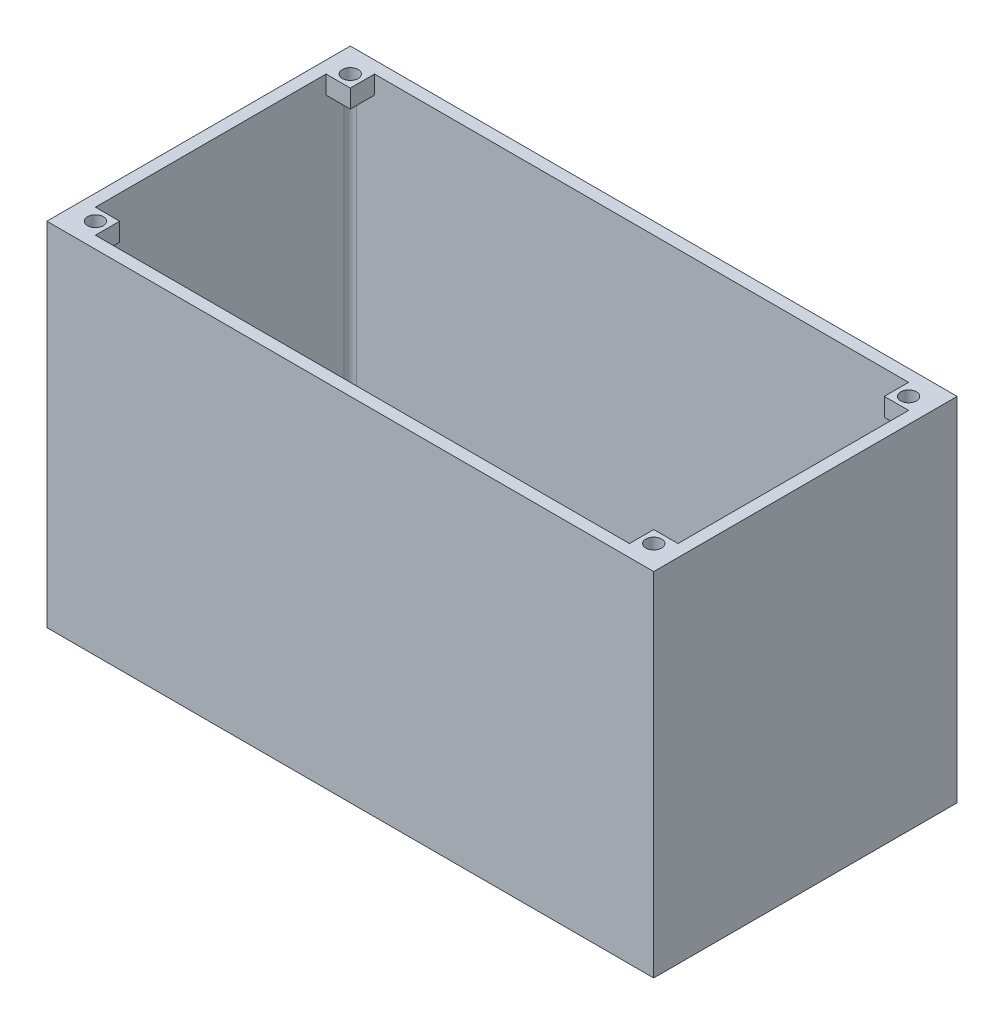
from build123d import *

# Parameters (mm, degrees)
SKETCH1_W               = 127
SKETCH1_H               = 63.5
BOSS_EXTRUDE1_DEPTH     = 302.26
SKETCH2_W               = 121.92
SKETCH2_H               = 58.42
CUT_EXTRUDE1_DEPTH      = 299.72
FILLET3_R               = 1.27
FILLET4_R               = 1.27
FILLET5_R               = 1.27
FILLET6_R               = 1.27
SKETCH3_R               = 12.7
CUT_EXTRUDE3_DEPTH      = 254
SKETCH4_W               = 127
SKETCH4_H               = 63.5
CUT_EXTRUDE4_DEPTH      = 2.54
CUT_EXTRUDE5_DEPTH      = 8.128
CUT_EXTRUDE5_DEPTH_BACK = 25.4
SKETCH5_W               = 100.000000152
SKETCH5_H               = 164.999999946
SKETCH6_R               = 1.600000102
BOSS_EXTRUDE3_DEPTH     = 8.000000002
BOSS_EXTRUDE4_DEPTH     = 7.99999924
BOSS_EXTRUDE5_DEPTH     = 7.99999924
BOSS_EXTRUDE6_DEPTH     = 7.99999924
SKETCH12_W              = 127
SKETCH12_H              = 63.5
CUT_EXTRUDE6_DEPTH      = 226.06
SKETCH13_R              = 1.651
BOSS_EXTRUDE7_DEPTH     = 3.81


with BuildPart() as part:
    # Sketch1 → Boss-Extrude1 (new body)
    with BuildSketch(Plane(origin=(0, 0, 0), x_dir=(1, 0, 0), z_dir=(0, 1, 0))):
        with Locations((63.5, 31.75)):
            Rectangle(SKETCH1_W, SKETCH1_H)
    extrude(amount=-BOSS_EXTRUDE1_DEPTH)

    # Sketch2 → Cut-Extrude1 (cut)
    with BuildSketch(Plane.XZ.offset(302.26)):
        with Locations((63.5, -31.75)):
            Rectangle(SKETCH2_W, SKETCH2_H)
    extrude(amount=-CUT_EXTRUDE1_DEPTH, mode=Mode.SUBTRACT)

    # Fillet3
    fillet3_edges = [part.edges().sort_by_distance(p)[0] for p in [
        (2.54, -152.4, -60.96),
    ]]
    fillet(fillet3_edges, radius=FILLET3_R)

    # Fillet4
    fillet4_edges = [part.edges().sort_by_distance(p)[0] for p in [
        (2.54, -152.4, -2.54),
    ]]
    fillet(fillet4_edges, radius=FILLET4_R)

    # Fillet5
    fillet5_edges = [part.edges().sort_by_distance(p)[0] for p in [
        (124.46, -152.4, -2.54),
    ]]
    fillet(fillet5_edges, radius=FILLET5_R)

    # Fillet6
    fillet6_edges = [part.edges().sort_by_distance(p)[0] for p in [
        (124.46, -152.4, -60.96),
    ]]
    fillet(fillet6_edges, radius=FILLET6_R)

    # Sketch3 → Cut-Extrude3 (cut)
    with BuildSketch(Plane.ZY):
        with Locations(Location((-31.75, -152.4, 0), (0, 0, 180))):
            Circle(SKETCH3_R)
    extrude(amount=-CUT_EXTRUDE3_DEPTH, mode=Mode.SUBTRACT)

    # Sketch4 → Cut-Extrude4 (cut)
    with BuildSketch(Plane(origin=(0, 0, 0), x_dir=(1, 0, 0), z_dir=(0, 1, 0))):
        with Locations((63.5, 31.75)):
            Rectangle(SKETCH4_W, SKETCH4_H)
    extrude(amount=-CUT_EXTRUDE4_DEPTH, mode=Mode.SUBTRACT)

    # Sketch5 → Cut-Extrude5 (cut, two sides: drawn at the far end of the back side and taken through both)
    with BuildSketch(Plane.XY.offset(-CUT_EXTRUDE5_DEPTH_BACK)):
        with Locations((63.5, -107.899999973)):
            Rectangle(SKETCH5_W, SKETCH5_H)
    extrude(amount=CUT_EXTRUDE5_DEPTH + CUT_EXTRUDE5_DEPTH_BACK, mode=Mode.SUBTRACT)

    # Sketch6 → Boss-Extrude3 (add)
    with BuildSketch(Plane(origin=(0, 0, -2.54), x_dir=(-1, 0, 0), z_dir=(0, 0, -1))):
        Polygon((-11.57603843, -17.860000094), (-9.03603843, -17.860000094), (-9.03603843, -22.940000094), (-14.11603843, -22.940000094), (-14.11603843, -17.860000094), align=None)
        with Locations((-11.57603843, -20.400000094)):
            Circle(SKETCH6_R, mode=Mode.SUBTRACT)
    extrude(amount=BOSS_EXTRUDE3_DEPTH)

    # Sketch8 → Boss-Extrude4 (add)
    with BuildSketch(Plane(origin=(0, 0, -2.54), x_dir=(-1, 0, 0), z_dir=(0, 0, -1))):
        with BuildLine():
            Line((-116.55537096, -19.268629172), (-117.964000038, -17.860000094))
            Line((-117.964000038, -17.860000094), (-117.964000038, -22.940000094))
            Line((-117.964000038, -22.940000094), (-116.55537096, -21.531371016))
            ThreePointArc((-116.55537096, -21.531371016), (-117.02400014, -20.400000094), (-116.55537096, -19.268629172))
        make_face()
        with BuildLine():
            Line((-114.292629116, -19.268629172), (-112.884000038, -17.860000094))
            Line((-112.884000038, -17.860000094), (-117.964000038, -17.860000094))
            Line((-117.964000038, -17.860000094), (-116.55537096, -19.268629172))
            ThreePointArc((-116.55537096, -19.268629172), (-115.424000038, -18.799999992), (-114.292629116, -19.268629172))
        make_face()
        with BuildLine():
            Line((-112.884000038, -22.940000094), (-112.884000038, -17.860000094))
            Line((-112.884000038, -17.860000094), (-114.292629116, -19.268629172))
            ThreePointArc((-114.292629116, -19.268629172), (-113.945792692, -19.787706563), (-113.823999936, -20.400000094))
            ThreePointArc((-113.823999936, -20.400000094), (-113.945792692, -21.012293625), (-114.292629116, -21.531371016))
            Line((-114.292629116, -21.531371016), (-112.884000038, -22.940000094))
        make_face()
        with BuildLine():
            Line((-117.964000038, -22.940000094), (-112.884000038, -22.940000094))
            Line((-112.884000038, -22.940000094), (-114.292629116, -21.531371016))
            ThreePointArc((-114.292629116, -21.531371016), (-115.424000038, -22.000000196), (-116.55537096, -21.531371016))
            Line((-116.55537096, -21.531371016), (-117.964000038, -22.940000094))
        make_face()
    extrude(amount=BOSS_EXTRUDE4_DEPTH)

    # Sketch10 → Boss-Extrude5 (add)
    with BuildSketch(Plane(origin=(0, 0, -2.54), x_dir=(-1, 0, 0), z_dir=(0, 0, -1))):
        with BuildLine():
            Line((-116.55537096, -194.26862893), (-117.964000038, -192.859999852))
            Line((-117.964000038, -192.859999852), (-117.964000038, -197.939999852))
            Line((-117.964000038, -197.939999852), (-116.55537096, -196.531370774))
            ThreePointArc((-116.55537096, -196.531370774), (-117.02400014, -195.399999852), (-116.55537096, -194.26862893))
        make_face()
        with BuildLine():
            Line((-112.884000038, -192.859999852), (-117.964000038, -192.859999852))
            Line((-117.964000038, -192.859999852), (-116.55537096, -194.26862893))
            ThreePointArc((-116.55537096, -194.26862893), (-115.424000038, -193.79999975), (-114.292629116, -194.26862893))
            Line((-114.292629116, -194.26862893), (-112.884000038, -192.859999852))
        make_face()
        with BuildLine():
            Line((-112.884000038, -197.939999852), (-112.884000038, -192.859999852))
            Line((-112.884000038, -192.859999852), (-114.292629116, -194.26862893))
            ThreePointArc((-114.292629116, -194.26862893), (-113.945792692, -194.787706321), (-113.823999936, -195.399999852))
            ThreePointArc((-113.823999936, -195.399999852), (-113.945792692, -196.012293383), (-114.292629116, -196.531370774))
            Line((-114.292629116, -196.531370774), (-112.884000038, -197.939999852))
        make_face()
        with BuildLine():
            Line((-116.55537096, -196.531370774), (-117.964000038, -197.939999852))
            Line((-117.964000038, -197.939999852), (-112.884000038, -197.939999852))
            Line((-112.884000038, -197.939999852), (-114.292629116, -196.531370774))
            ThreePointArc((-114.292629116, -196.531370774), (-115.424000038, -196.999999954), (-116.55537096, -196.531370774))
        make_face()
    extrude(amount=BOSS_EXTRUDE5_DEPTH)

    # Sketch11 → Boss-Extrude6 (add)
    with BuildSketch(Plane(origin=(0, 0, -2.54), x_dir=(-1, 0, 0), z_dir=(0, 0, -1))):
        with BuildLine():
            Line((-12.707370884, -194.26862893), (-14.115999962, -192.859999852))
            Line((-14.115999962, -192.859999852), (-14.115999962, -197.939999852))
            Line((-14.115999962, -197.939999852), (-12.707370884, -196.531370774))
            ThreePointArc((-12.707370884, -196.531370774), (-13.176000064, -195.399999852), (-12.707370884, -194.26862893))
        make_face()
        with BuildLine():
            Line((-9.035999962, -192.859999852), (-14.115999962, -192.859999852))
            Line((-14.115999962, -192.859999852), (-12.707370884, -194.26862893))
            ThreePointArc((-12.707370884, -194.26862893), (-11.575999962, -193.79999975), (-10.44462904, -194.26862893))
            Line((-10.44462904, -194.26862893), (-9.035999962, -192.859999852))
        make_face()
        with BuildLine():
            Line((-9.035999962, -197.939999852), (-9.035999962, -192.859999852))
            Line((-9.035999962, -192.859999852), (-10.44462904, -194.26862893))
            ThreePointArc((-10.44462904, -194.26862893), (-10.097792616, -194.787706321), (-9.97599986, -195.399999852))
            ThreePointArc((-9.97599986, -195.399999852), (-10.097792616, -196.012293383), (-10.44462904, -196.531370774))
            Line((-10.44462904, -196.531370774), (-9.035999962, -197.939999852))
        make_face()
        with BuildLine():
            Line((-12.707370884, -196.531370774), (-14.115999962, -197.939999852))
            Line((-14.115999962, -197.939999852), (-9.035999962, -197.939999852))
            Line((-9.035999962, -197.939999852), (-10.44462904, -196.531370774))
            ThreePointArc((-10.44462904, -196.531370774), (-11.575999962, -196.999999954), (-12.707370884, -196.531370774))
        make_face()
    extrude(amount=BOSS_EXTRUDE6_DEPTH)

    # Sketch12 → Cut-Extrude6 (cut)
    with BuildSketch(Plane(origin=(0, -2.54, 0), x_dir=(1, 0, 0), z_dir=(0, 1, 0))):
        with Locations((63.5, 31.75)):
            Rectangle(SKETCH12_W, SKETCH12_H)
    extrude(amount=-CUT_EXTRUDE6_DEPTH, mode=Mode.SUBTRACT)

    # Sketch13 → Boss-Extrude7 (add)
    # profile 1 of 7: a face of its own
    with BuildSketch(Plane(origin=(0, -228.6, 0), x_dir=(1, 0, 0), z_dir=(0, 1, 0))):
        with BuildLine():
            Line((119.38, 7.62), (119.38, 2.54))
            Line((119.38, 2.54), (123.19, 2.54))
            ThreePointArc((123.19, 2.54), (124.088025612, 2.911974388), (124.46, 3.81))
            Line((124.46, 3.81), (124.46, 7.62))
            Line((124.46, 7.62), (119.38, 7.62))
        make_face()
        with Locations(Location((121.92, 5.08, 0), (0, 0, 270))):
            Circle(SKETCH13_R, mode=Mode.SUBTRACT)
    # profile 2 of 7: a face of its own
    with BuildSketch(Plane(origin=(0, -228.6, 0), x_dir=(1, 0, 0), z_dir=(0, 1, 0))):
        with BuildLine():
            Line((119.38, 60.96), (119.38, 55.88))
            Line((119.38, 55.88), (120.752566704, 57.252566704))
            ThreePointArc((120.752566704, 57.252566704), (120.269, 58.42), (120.752566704, 59.587433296))
            Line((120.752566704, 59.587433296), (119.38, 60.96))
        make_face()
    # profile 3 of 7: a face of its own
    with BuildSketch(Plane(origin=(0, -228.6, 0), x_dir=(1, 0, 0), z_dir=(0, 1, 0))):
        with BuildLine():
            Line((123.19, 60.96), (119.38, 60.96))
            Line((119.38, 60.96), (120.752566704, 59.587433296))
            ThreePointArc((120.752566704, 59.587433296), (121.92, 60.071), (123.087433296, 59.587433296))
            Line((123.087433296, 59.587433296), (124.088025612, 60.588025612))
            ThreePointArc((124.088025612, 60.588025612), (123.676007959, 60.863327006), (123.19, 60.96))
        make_face()
    # profile 4 of 7: a face of its own
    with BuildSketch(Plane(origin=(0, -228.6, 0), x_dir=(1, 0, 0), z_dir=(0, 1, 0))):
        with BuildLine():
            Line((123.087433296, 57.252566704), (124.46, 55.88))
            Line((124.46, 55.88), (124.46, 59.69))
            ThreePointArc((124.46, 59.69), (124.363327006, 60.176007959), (124.088025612, 60.588025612))
            Line((124.088025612, 60.588025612), (123.087433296, 59.587433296))
            ThreePointArc((123.087433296, 59.587433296), (123.445325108, 59.051810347), (123.571, 58.42))
            ThreePointArc((123.571, 58.42), (123.445325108, 57.788189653), (123.087433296, 57.252566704))
        make_face()
    # profile 5 of 7: a face of its own
    with BuildSketch(Plane(origin=(0, -228.6, 0), x_dir=(1, 0, 0), z_dir=(0, 1, 0))):
        with BuildLine():
            Line((119.38, 55.88), (124.46, 55.88))
            Line((124.46, 55.88), (123.087433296, 57.252566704))
            ThreePointArc((123.087433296, 57.252566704), (121.92, 56.769), (120.752566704, 57.252566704))
            Line((120.752566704, 57.252566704), (119.38, 55.88))
        make_face()
    # profile 6 of 7: a face of its own
    with BuildSketch(Plane(origin=(0, -228.6, 0), x_dir=(1, 0, 0), z_dir=(0, 1, 0))):
        with BuildLine():
            ThreePointArc((2.54, 3.81), (2.911974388, 2.911974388), (3.81, 2.54))
            Line((3.81, 2.54), (7.62, 2.54))
            Line((7.62, 2.54), (7.62, 7.62))
            Line((7.62, 7.62), (2.54, 7.62))
            Line((2.54, 7.62), (2.54, 3.81))
        make_face()
        with Locations(Location((5.08, 5.08, 0), (0, 0, 270))):
            Circle(SKETCH13_R, mode=Mode.SUBTRACT)
    # profile 7 of 7: a face of its own
    with BuildSketch(Plane(origin=(0, -228.6, 0), x_dir=(1, 0, 0), z_dir=(0, 1, 0))):
        with BuildLine():
            Line((2.54, 59.69), (2.54, 55.88))
            Line((2.54, 55.88), (7.62, 55.88))
            Line((7.62, 55.88), (7.62, 60.96))
            Line((7.62, 60.96), (3.81, 60.96))
            ThreePointArc((3.81, 60.96), (2.911974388, 60.588025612), (2.54, 59.69))
        make_face()
        with Locations(Location((5.08, 58.42, 0), (0, 0, 270))):
            Circle(SKETCH13_R, mode=Mode.SUBTRACT)
    extrude(amount=-BOSS_EXTRUDE7_DEPTH)


solid = part.part
